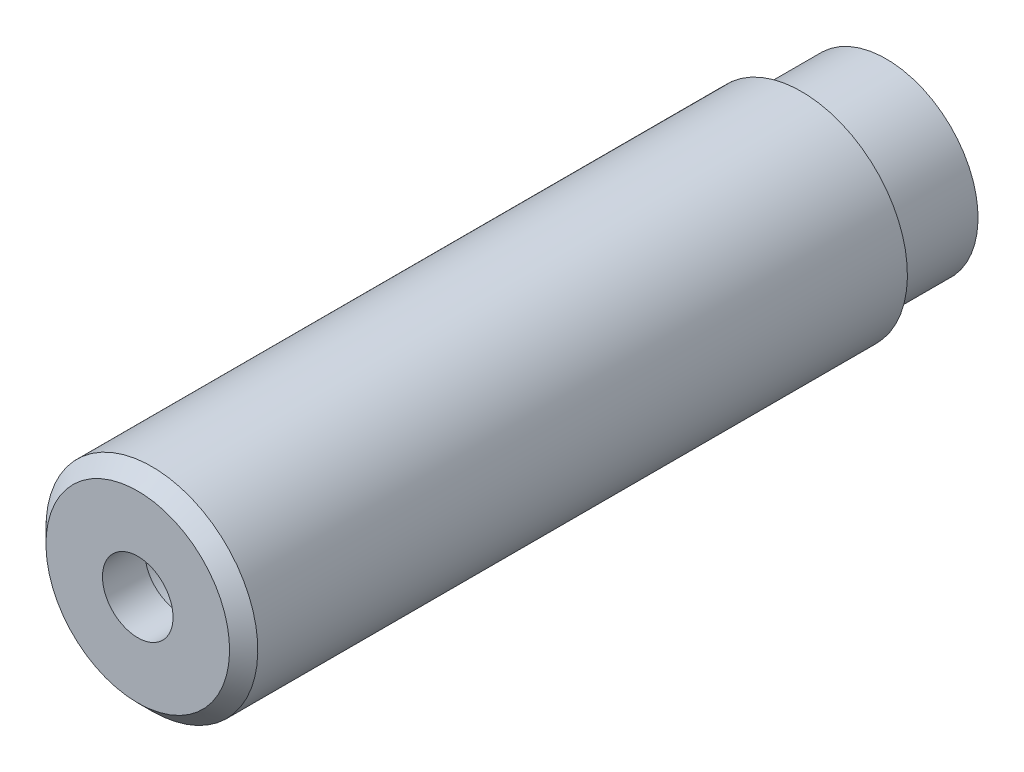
ISO-10303-21;
HEADER;
FILE_DESCRIPTION(('STEP AP214'),'2;1');
FILE_NAME('part.step','',(''),(''),'','','');
FILE_SCHEMA(('AUTOMOTIVE_DESIGN { 1 0 10303 214 1 1 1 1 }'));
ENDSEC;
DATA;
#1=APPLICATION_CONTEXT('core data for automotive mechanical design processes');
#2=APPLICATION_PROTOCOL_DEFINITION('international standard','automotive_design',2000,#1);
#3=PRODUCT_CONTEXT('',#1,'mechanical');
#4=PRODUCT('Part','Part','',(#3));
#5=PRODUCT_RELATED_PRODUCT_CATEGORY('part','',(#4));
#6=PRODUCT_DEFINITION_FORMATION('','',#4);
#7=PRODUCT_DEFINITION_CONTEXT('part definition',#1,'design');
#8=PRODUCT_DEFINITION('design','',#6,#7);
#9=PRODUCT_DEFINITION_SHAPE('','',#8);
#10=(LENGTH_UNIT() NAMED_UNIT(*) SI_UNIT(.MILLI.,.METRE.));
#11=(NAMED_UNIT(*) PLANE_ANGLE_UNIT() SI_UNIT($,.RADIAN.));
#12=(NAMED_UNIT(*) SI_UNIT($,.STERADIAN.) SOLID_ANGLE_UNIT());
#13=UNCERTAINTY_MEASURE_WITH_UNIT(LENGTH_MEASURE(1.E-05),#10,'distance_accuracy_value','');
#14=(GEOMETRIC_REPRESENTATION_CONTEXT(3) GLOBAL_UNCERTAINTY_ASSIGNED_CONTEXT((#13)) GLOBAL_UNIT_ASSIGNED_CONTEXT((#10,
#11,#12)) REPRESENTATION_CONTEXT('',''));
#15=CARTESIAN_POINT('',(0.,0.,0.));
#16=DIRECTION('',(0.,0.,1.));
#17=DIRECTION('',(1.,0.,0.));
#18=AXIS2_PLACEMENT_3D('',#15,#16,#17);
#19=CARTESIAN_POINT('',(0.,0.,87.));
#20=DIRECTION('',(0.,0.,1.));
#21=DIRECTION('',(0.,-1.,0.));
#22=AXIS2_PLACEMENT_3D('',#19,#20,#21);
#23=CYLINDRICAL_SURFACE('',#22,2.5);
#24=CARTESIAN_POINT('',(0.,0.,53.));
#25=DIRECTION('',(0.,0.,1.));
#26=DIRECTION('',(0.,-1.,0.));
#27=AXIS2_PLACEMENT_3D('',#24,#25,#26);
#28=CIRCLE('',#27,2.5);
#29=CARTESIAN_POINT('',(0.,-2.5,53.));
#30=VERTEX_POINT('',#29);
#31=EDGE_CURVE('E23',#30,#30,#28,.T.);
#32=ORIENTED_EDGE('',*,*,#31,.T.);
#33=EDGE_LOOP('',(#32));
#34=FACE_BOUND('',#33,.T.);
#35=CARTESIAN_POINT('',(0.,0.,50.));
#36=DIRECTION('',(0.,0.,-1.));
#37=DIRECTION('',(0.,1.,0.));
#38=AXIS2_PLACEMENT_3D('',#35,#36,#37);
#39=CIRCLE('',#38,2.5);
#40=CARTESIAN_POINT('',(0.,2.5,50.));
#41=VERTEX_POINT('',#40);
#42=EDGE_CURVE('E15',#41,#41,#39,.T.);
#43=ORIENTED_EDGE('',*,*,#42,.T.);
#44=EDGE_LOOP('',(#43));
#45=FACE_BOUND('',#44,.T.);
#46=ADVANCED_FACE('F12',(#34,#45),#23,.F.);
#47=CARTESIAN_POINT('',(6.5,0.,0.));
#48=DIRECTION('',(0.,0.,-1.));
#49=DIRECTION('',(0.,1.,0.));
#50=AXIS2_PLACEMENT_3D('',#47,#48,#49);
#51=PLANE('',#50);
#52=CARTESIAN_POINT('',(0.,0.,0.));
#53=DIRECTION('',(0.,0.,1.));
#54=DIRECTION('',(0.,-1.,0.));
#55=AXIS2_PLACEMENT_3D('',#52,#53,#54);
#56=CIRCLE('',#55,6.5);
#57=CARTESIAN_POINT('',(0.,-6.5,0.));
#58=VERTEX_POINT('',#57);
#59=EDGE_CURVE('E34',#58,#58,#56,.T.);
#60=ORIENTED_EDGE('',*,*,#59,.F.);
#61=EDGE_LOOP('',(#60));
#62=FACE_BOUND('',#61,.T.);
#63=CARTESIAN_POINT('',(0.,0.,0.));
#64=DIRECTION('',(0.,0.,-1.));
#65=DIRECTION('',(0.,1.,0.));
#66=AXIS2_PLACEMENT_3D('',#63,#64,#65);
#67=CIRCLE('',#66,4.5);
#68=CARTESIAN_POINT('',(0.,4.5,0.));
#69=VERTEX_POINT('',#68);
#70=EDGE_CURVE('E37',#69,#69,#67,.T.);
#71=ORIENTED_EDGE('',*,*,#70,.F.);
#72=EDGE_LOOP('',(#71));
#73=FACE_BOUND('',#72,.T.);
#74=ADVANCED_FACE('F63',(#62,#73),#51,.T.);
#75=CARTESIAN_POINT('',(2.5,0.,53.));
#76=DIRECTION('',(0.,0.,1.));
#77=DIRECTION('',(0.,-1.,0.));
#78=AXIS2_PLACEMENT_3D('',#75,#76,#77);
#79=PLANE('',#78);
#80=CARTESIAN_POINT('',(0.,0.,53.));
#81=DIRECTION('',(0.,0.,1.));
#82=DIRECTION('',(0.,-1.,0.));
#83=AXIS2_PLACEMENT_3D('',#80,#81,#82);
#84=CIRCLE('',#83,6.5);
#85=CARTESIAN_POINT('',(0.,-6.5,53.));
#86=VERTEX_POINT('',#85);
#87=EDGE_CURVE('E19',#86,#86,#84,.T.);
#88=ORIENTED_EDGE('',*,*,#87,.T.);
#89=EDGE_LOOP('',(#88));
#90=FACE_BOUND('',#89,.T.);
#91=ORIENTED_EDGE('',*,*,#31,.F.);
#92=EDGE_LOOP('',(#91));
#93=FACE_BOUND('',#92,.T.);
#94=ADVANCED_FACE('F69',(#90,#93),#79,.T.);
#95=CARTESIAN_POINT('',(0.,0.,87.));
#96=DIRECTION('',(0.,0.,1.));
#97=DIRECTION('',(0.,-1.,0.));
#98=AXIS2_PLACEMENT_3D('',#95,#96,#97);
#99=CYLINDRICAL_SURFACE('',#98,7.5);
#100=CARTESIAN_POINT('',(0.,0.,52.));
#101=DIRECTION('',(0.,0.,1.));
#102=DIRECTION('',(0.,-1.,0.));
#103=AXIS2_PLACEMENT_3D('',#100,#101,#102);
#104=CIRCLE('',#103,7.5);
#105=CARTESIAN_POINT('',(0.,-7.5,52.));
#106=VERTEX_POINT('',#105);
#107=EDGE_CURVE('E8',#106,#106,#104,.F.);
#108=ORIENTED_EDGE('',*,*,#107,.T.);
#109=EDGE_LOOP('',(#108));
#110=FACE_BOUND('',#109,.T.);
#111=CARTESIAN_POINT('',(0.,0.,6.));
#112=DIRECTION('',(0.,0.,1.));
#113=DIRECTION('',(0.,-1.,0.));
#114=AXIS2_PLACEMENT_3D('',#111,#112,#113);
#115=CIRCLE('',#114,7.5);
#116=CARTESIAN_POINT('',(0.,-7.5,6.));
#117=VERTEX_POINT('',#116);
#118=EDGE_CURVE('E28',#117,#117,#115,.T.);
#119=ORIENTED_EDGE('',*,*,#118,.T.);
#120=EDGE_LOOP('',(#119));
#121=FACE_BOUND('',#120,.T.);
#122=ADVANCED_FACE('F78',(#110,#121),#99,.T.);
#123=CARTESIAN_POINT('',(7.5,0.,6.));
#124=DIRECTION('',(0.,0.,-1.));
#125=DIRECTION('',(0.,1.,0.));
#126=AXIS2_PLACEMENT_3D('',#123,#124,#125);
#127=PLANE('',#126);
#128=CARTESIAN_POINT('',(0.,0.,6.));
#129=DIRECTION('',(0.,0.,1.));
#130=DIRECTION('',(0.,-1.,0.));
#131=AXIS2_PLACEMENT_3D('',#128,#129,#130);
#132=CIRCLE('',#131,6.5);
#133=CARTESIAN_POINT('',(0.,-6.5,6.));
#134=VERTEX_POINT('',#133);
#135=EDGE_CURVE('E31',#134,#134,#132,.T.);
#136=ORIENTED_EDGE('',*,*,#135,.T.);
#137=EDGE_LOOP('',(#136));
#138=FACE_BOUND('',#137,.T.);
#139=ORIENTED_EDGE('',*,*,#118,.F.);
#140=EDGE_LOOP('',(#139));
#141=FACE_BOUND('',#140,.T.);
#142=ADVANCED_FACE('F84',(#138,#141),#127,.T.);
#143=CARTESIAN_POINT('',(0.,0.,87.));
#144=DIRECTION('',(0.,0.,1.));
#145=DIRECTION('',(0.,-1.,0.));
#146=AXIS2_PLACEMENT_3D('',#143,#144,#145);
#147=CYLINDRICAL_SURFACE('',#146,6.5);
#148=ORIENTED_EDGE('',*,*,#59,.T.);
#149=EDGE_LOOP('',(#148));
#150=FACE_BOUND('',#149,.T.);
#151=ORIENTED_EDGE('',*,*,#135,.F.);
#152=EDGE_LOOP('',(#151));
#153=FACE_BOUND('',#152,.T.);
#154=ADVANCED_FACE('F59',(#150,#153),#147,.T.);
#155=CARTESIAN_POINT('',(0.,0.,53.));
#156=DIRECTION('',(0.,0.,-1.));
#157=DIRECTION('',(0.,1.,0.));
#158=AXIS2_PLACEMENT_3D('',#155,#156,#157);
#159=CONICAL_SURFACE('',#158,6.5,0.785398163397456);
#160=ORIENTED_EDGE('',*,*,#107,.F.);
#161=EDGE_LOOP('',(#160));
#162=FACE_BOUND('',#161,.T.);
#163=ORIENTED_EDGE('',*,*,#87,.F.);
#164=EDGE_LOOP('',(#163));
#165=FACE_BOUND('',#164,.T.);
#166=ADVANCED_FACE('F48',(#162,#165),#159,.T.);
#167=CARTESIAN_POINT('',(0.,0.,50.));
#168=DIRECTION('',(0.,0.,-1.));
#169=DIRECTION('',(0.,1.,0.));
#170=AXIS2_PLACEMENT_3D('',#167,#168,#169);
#171=CYLINDRICAL_SURFACE('',#170,4.5);
#172=ORIENTED_EDGE('',*,*,#70,.T.);
#173=EDGE_LOOP('',(#172));
#174=FACE_BOUND('',#173,.T.);
#175=CARTESIAN_POINT('',(0.,0.,50.));
#176=DIRECTION('',(0.,0.,-1.));
#177=DIRECTION('',(0.,1.,0.));
#178=AXIS2_PLACEMENT_3D('',#175,#176,#177);
#179=CIRCLE('',#178,4.5);
#180=CARTESIAN_POINT('',(0.,4.5,50.));
#181=VERTEX_POINT('',#180);
#182=EDGE_CURVE('E40',#181,#181,#179,.T.);
#183=ORIENTED_EDGE('',*,*,#182,.F.);
#184=EDGE_LOOP('',(#183));
#185=FACE_BOUND('',#184,.T.);
#186=ADVANCED_FACE('F46',(#174,#185),#171,.F.);
#187=CARTESIAN_POINT('',(0.,0.,50.));
#188=DIRECTION('',(0.,0.,-1.));
#189=DIRECTION('',(0.,1.,0.));
#190=AXIS2_PLACEMENT_3D('',#187,#188,#189);
#191=PLANE('',#190);
#192=ORIENTED_EDGE('',*,*,#42,.F.);
#193=EDGE_LOOP('',(#192));
#194=FACE_BOUND('',#193,.T.);
#195=ORIENTED_EDGE('',*,*,#182,.T.);
#196=EDGE_LOOP('',(#195));
#197=FACE_BOUND('',#196,.T.);
#198=ADVANCED_FACE('F44',(#194,#197),#191,.T.);
#199=CLOSED_SHELL('',(#46,#74,#94,#122,#142,#154,#166,#186,#198));
#200=MANIFOLD_SOLID_BREP('B1',#199);
#201=ADVANCED_BREP_SHAPE_REPRESENTATION('',(#18,#200),#14);
#202=SHAPE_DEFINITION_REPRESENTATION(#9,#201);
ENDSEC;
END-ISO-10303-21;
